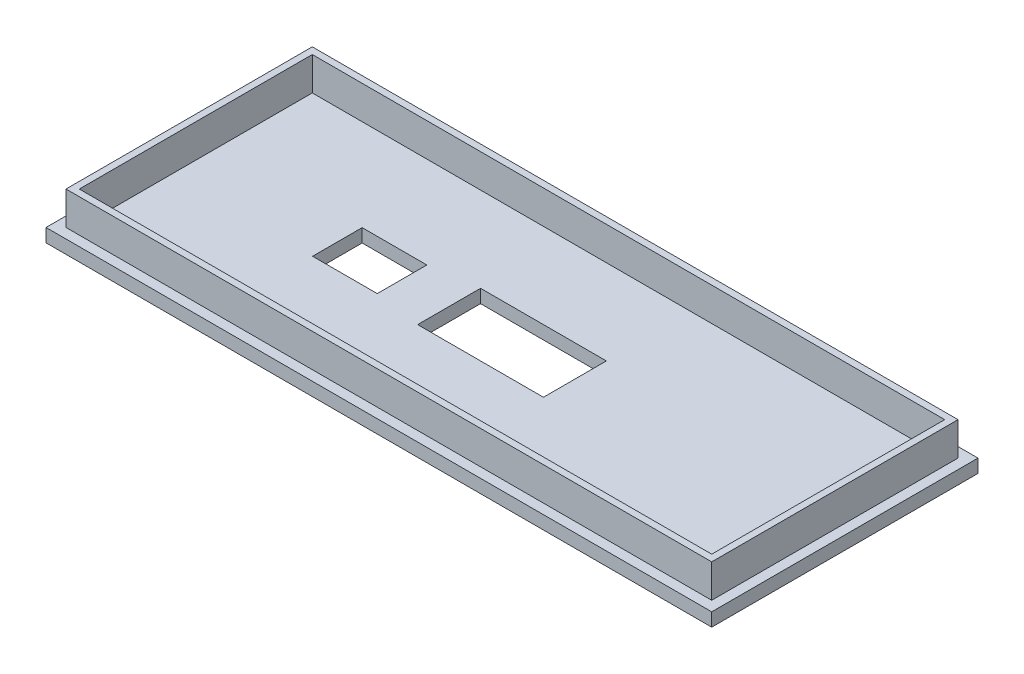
from build123d import *

# Parameters (mm, degrees)
SKETCH1_W           = 127
SKETCH1_H           = 50.8
BOSS_EXTRUDE1_DEPTH = 2.54
SKETCH2_W           = 123.19
SKETCH2_H           = 46.99
BOSS_EXTRUDE2_DEPTH = 6.35
SKETCH3_W           = 120.65
SKETCH3_H           = 44.45
CUT_EXTRUDE1_DEPTH  = 6.35
SKETCH4_W           = 24
SKETCH4_H           = 12
SKETCH4_W_2         = 12.339103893
SKETCH4_H_2         = 9.459979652
CUT_EXTRUDE2_DEPTH  = 10


with BuildPart() as part:
    # Sketch1 → Boss-Extrude1 (new body)
    with BuildSketch(Plane(origin=(0, 0, 0), x_dir=(1, 0, 0), z_dir=(0, 1, 0))):
        Rectangle(SKETCH1_W, SKETCH1_H)
    extrude(amount=BOSS_EXTRUDE1_DEPTH)

    # Sketch2 → Boss-Extrude2 (add)
    with BuildSketch(Plane(origin=(0, 2.54, 0), x_dir=(1, 0, 0), z_dir=(0, 1, 0))):
        Rectangle(SKETCH2_W, SKETCH2_H)
    extrude(amount=BOSS_EXTRUDE2_DEPTH)

    # Sketch3 → Cut-Extrude1 (cut)
    with BuildSketch(Plane(origin=(0, 8.89, 0), x_dir=(1, 0, 0), z_dir=(0, 1, 0))):
        Rectangle(SKETCH3_W, SKETCH3_H)
    extrude(amount=-CUT_EXTRUDE1_DEPTH, mode=Mode.SUBTRACT)

    # Sketch4 → Cut-Extrude2 (cut)
    with BuildSketch(Plane(origin=(0, 2.54, 0), x_dir=(1, 0, 0), z_dir=(0, 1, 0))):
        Rectangle(SKETCH4_W, SKETCH4_H)
        with Locations((-27.146028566, 0)):
            Rectangle(SKETCH4_W_2, SKETCH4_H_2)
    extrude(amount=-CUT_EXTRUDE2_DEPTH, mode=Mode.SUBTRACT)


solid = part.part
